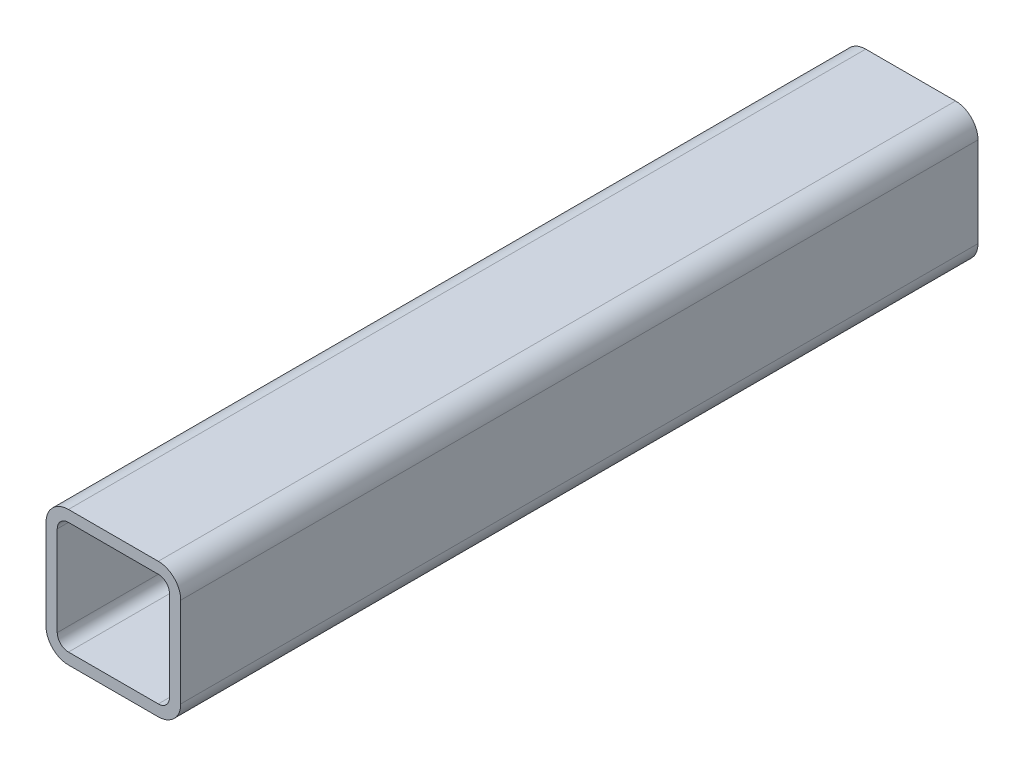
ISO-10303-21;
HEADER;
FILE_DESCRIPTION(('STEP AP214'),'2;1');
FILE_NAME('part.step','',(''),(''),'','','');
FILE_SCHEMA(('AUTOMOTIVE_DESIGN { 1 0 10303 214 1 1 1 1 }'));
ENDSEC;
DATA;
#1=APPLICATION_CONTEXT('core data for automotive mechanical design processes');
#2=APPLICATION_PROTOCOL_DEFINITION('international standard','automotive_design',2000,#1);
#3=PRODUCT_CONTEXT('',#1,'mechanical');
#4=PRODUCT('Part','Part','',(#3));
#5=PRODUCT_RELATED_PRODUCT_CATEGORY('part','',(#4));
#6=PRODUCT_DEFINITION_FORMATION('','',#4);
#7=PRODUCT_DEFINITION_CONTEXT('part definition',#1,'design');
#8=PRODUCT_DEFINITION('design','',#6,#7);
#9=PRODUCT_DEFINITION_SHAPE('','',#8);
#10=(LENGTH_UNIT() NAMED_UNIT(*) SI_UNIT(.MILLI.,.METRE.));
#11=(NAMED_UNIT(*) PLANE_ANGLE_UNIT() SI_UNIT($,.RADIAN.));
#12=(NAMED_UNIT(*) SI_UNIT($,.STERADIAN.) SOLID_ANGLE_UNIT());
#13=UNCERTAINTY_MEASURE_WITH_UNIT(LENGTH_MEASURE(1.E-05),#10,'distance_accuracy_value','');
#14=(GEOMETRIC_REPRESENTATION_CONTEXT(3) GLOBAL_UNCERTAINTY_ASSIGNED_CONTEXT((#13)) GLOBAL_UNIT_ASSIGNED_CONTEXT((#10,
#11,#12)) REPRESENTATION_CONTEXT('',''));
#15=CARTESIAN_POINT('',(0.,0.,0.));
#16=DIRECTION('',(0.,0.,1.));
#17=DIRECTION('',(1.,0.,0.));
#18=AXIS2_PLACEMENT_3D('',#15,#16,#17);
#19=CARTESIAN_POINT('',(-25.4,25.4,450.85));
#20=DIRECTION('',(0.,0.,-1.));
#21=DIRECTION('',(-1.,0.,0.));
#22=AXIS2_PLACEMENT_3D('',#19,#20,#21);
#23=CYLINDRICAL_SURFACE('',#22,12.7);
#24=CARTESIAN_POINT('',(-25.4,25.4,0.));
#25=DIRECTION('',(0.,0.,-1.));
#26=DIRECTION('',(-1.,0.,0.));
#27=AXIS2_PLACEMENT_3D('',#24,#25,#26);
#28=CIRCLE('',#27,12.7);
#29=CARTESIAN_POINT('',(-38.1,25.4,0.));
#30=VERTEX_POINT('',#29);
#31=CARTESIAN_POINT('',(-25.4,38.1,0.));
#32=VERTEX_POINT('',#31);
#33=EDGE_CURVE('E199',#30,#32,#28,.T.);
#34=ORIENTED_EDGE('',*,*,#33,.F.);
#35=DIRECTION('',(0.,0.,-1.));
#36=VECTOR('',#35,1.);
#37=CARTESIAN_POINT('',(-38.1,25.4,450.85));
#38=LINE('',#37,#36);
#39=CARTESIAN_POINT('',(-38.1,25.4,450.85));
#40=VERTEX_POINT('',#39);
#41=EDGE_CURVE('E11',#40,#30,#38,.T.);
#42=ORIENTED_EDGE('',*,*,#41,.F.);
#43=CARTESIAN_POINT('',(-25.4,25.4,450.85));
#44=DIRECTION('',(0.,0.,-1.));
#45=DIRECTION('',(-1.,0.,0.));
#46=AXIS2_PLACEMENT_3D('',#43,#44,#45);
#47=CIRCLE('',#46,12.7);
#48=CARTESIAN_POINT('',(-25.4,38.1,450.85));
#49=VERTEX_POINT('',#48);
#50=EDGE_CURVE('E211',#40,#49,#47,.T.);
#51=ORIENTED_EDGE('',*,*,#50,.T.);
#52=DIRECTION('',(0.,0.,-1.));
#53=VECTOR('',#52,1.);
#54=CARTESIAN_POINT('',(-25.4,38.1,450.85));
#55=LINE('',#54,#53);
#56=EDGE_CURVE('E35',#49,#32,#55,.T.);
#57=ORIENTED_EDGE('',*,*,#56,.T.);
#58=EDGE_LOOP('',(#34,#42,#51,#57));
#59=FACE_BOUND('',#58,.T.);
#60=ADVANCED_FACE('F32',(#59),#23,.T.);
#61=CARTESIAN_POINT('',(-38.1,25.4,450.85));
#62=DIRECTION('',(1.,0.,0.));
#63=DIRECTION('',(0.,0.,-1.));
#64=AXIS2_PLACEMENT_3D('',#61,#62,#63);
#65=PLANE('',#64);
#66=DIRECTION('',(0.,-1.,0.));
#67=VECTOR('',#66,1.);
#68=CARTESIAN_POINT('',(-38.1,25.4,0.));
#69=LINE('',#68,#67);
#70=CARTESIAN_POINT('',(-38.1,-25.4,0.));
#71=VERTEX_POINT('',#70);
#72=EDGE_CURVE('E215',#30,#71,#69,.T.);
#73=ORIENTED_EDGE('',*,*,#72,.T.);
#74=DIRECTION('',(0.,0.,-1.));
#75=VECTOR('',#74,1.);
#76=CARTESIAN_POINT('',(-38.1,-25.4,450.85));
#77=LINE('',#76,#75);
#78=CARTESIAN_POINT('',(-38.1,-25.4,450.85));
#79=VERTEX_POINT('',#78);
#80=EDGE_CURVE('E40',#79,#71,#77,.T.);
#81=ORIENTED_EDGE('',*,*,#80,.F.);
#82=DIRECTION('',(0.,-1.,0.));
#83=VECTOR('',#82,1.);
#84=CARTESIAN_POINT('',(-38.1,25.4,450.85));
#85=LINE('',#84,#83);
#86=EDGE_CURVE('E231',#40,#79,#85,.T.);
#87=ORIENTED_EDGE('',*,*,#86,.F.);
#88=ORIENTED_EDGE('',*,*,#41,.T.);
#89=EDGE_LOOP('',(#73,#81,#87,#88));
#90=FACE_BOUND('',#89,.T.);
#91=ADVANCED_FACE('F279',(#90),#65,.F.);
#92=CARTESIAN_POINT('',(-25.4,-25.4,450.85));
#93=DIRECTION('',(0.,0.,-1.));
#94=DIRECTION('',(-1.,0.,0.));
#95=AXIS2_PLACEMENT_3D('',#92,#93,#94);
#96=CYLINDRICAL_SURFACE('',#95,12.7);
#97=CARTESIAN_POINT('',(-25.4,-25.4,0.));
#98=DIRECTION('',(0.,0.,-1.));
#99=DIRECTION('',(-1.,0.,0.));
#100=AXIS2_PLACEMENT_3D('',#97,#98,#99);
#101=CIRCLE('',#100,12.7);
#102=CARTESIAN_POINT('',(-25.4,-38.1,0.));
#103=VERTEX_POINT('',#102);
#104=EDGE_CURVE('E249',#103,#71,#101,.T.);
#105=ORIENTED_EDGE('',*,*,#104,.F.);
#106=DIRECTION('',(0.,0.,-1.));
#107=VECTOR('',#106,1.);
#108=CARTESIAN_POINT('',(-25.4,-38.1,450.85));
#109=LINE('',#108,#107);
#110=CARTESIAN_POINT('',(-25.4,-38.1,450.85));
#111=VERTEX_POINT('',#110);
#112=EDGE_CURVE('E255',#111,#103,#109,.T.);
#113=ORIENTED_EDGE('',*,*,#112,.F.);
#114=CARTESIAN_POINT('',(-25.4,-25.4,450.85));
#115=DIRECTION('',(0.,0.,-1.));
#116=DIRECTION('',(-1.,0.,0.));
#117=AXIS2_PLACEMENT_3D('',#114,#115,#116);
#118=CIRCLE('',#117,12.7);
#119=EDGE_CURVE('E228',#111,#79,#118,.T.);
#120=ORIENTED_EDGE('',*,*,#119,.T.);
#121=ORIENTED_EDGE('',*,*,#80,.T.);
#122=EDGE_LOOP('',(#105,#113,#120,#121));
#123=FACE_BOUND('',#122,.T.);
#124=ADVANCED_FACE('F298',(#123),#96,.T.);
#125=CARTESIAN_POINT('',(25.4,-38.1,450.85));
#126=DIRECTION('',(0.,-1.,0.));
#127=DIRECTION('',(0.,0.,-1.));
#128=AXIS2_PLACEMENT_3D('',#125,#126,#127);
#129=PLANE('',#128);
#130=DIRECTION('',(-1.,0.,0.));
#131=VECTOR('',#130,1.);
#132=CARTESIAN_POINT('',(25.4,-38.1,0.));
#133=LINE('',#132,#131);
#134=CARTESIAN_POINT('',(25.4,-38.1,0.));
#135=VERTEX_POINT('',#134);
#136=EDGE_CURVE('E246',#135,#103,#133,.T.);
#137=ORIENTED_EDGE('',*,*,#136,.F.);
#138=DIRECTION('',(0.,0.,-1.));
#139=VECTOR('',#138,1.);
#140=CARTESIAN_POINT('',(25.4,-38.1,450.85));
#141=LINE('',#140,#139);
#142=CARTESIAN_POINT('',(25.4,-38.1,450.85));
#143=VERTEX_POINT('',#142);
#144=EDGE_CURVE('E257',#143,#135,#141,.T.);
#145=ORIENTED_EDGE('',*,*,#144,.F.);
#146=DIRECTION('',(-1.,0.,0.));
#147=VECTOR('',#146,1.);
#148=CARTESIAN_POINT('',(25.4,-38.1,450.85));
#149=LINE('',#148,#147);
#150=EDGE_CURVE('E225',#143,#111,#149,.T.);
#151=ORIENTED_EDGE('',*,*,#150,.T.);
#152=ORIENTED_EDGE('',*,*,#112,.T.);
#153=EDGE_LOOP('',(#137,#145,#151,#152));
#154=FACE_BOUND('',#153,.T.);
#155=ADVANCED_FACE('F296',(#154),#129,.T.);
#156=CARTESIAN_POINT('',(25.4,-25.4,450.85));
#157=DIRECTION('',(0.,0.,-1.));
#158=DIRECTION('',(-1.,0.,0.));
#159=AXIS2_PLACEMENT_3D('',#156,#157,#158);
#160=CYLINDRICAL_SURFACE('',#159,12.7);
#161=CARTESIAN_POINT('',(25.4,-25.4,0.));
#162=DIRECTION('',(0.,0.,-1.));
#163=DIRECTION('',(-1.,0.,0.));
#164=AXIS2_PLACEMENT_3D('',#161,#162,#163);
#165=CIRCLE('',#164,12.7);
#166=CARTESIAN_POINT('',(38.1,-25.4,0.));
#167=VERTEX_POINT('',#166);
#168=EDGE_CURVE('E243',#167,#135,#165,.T.);
#169=ORIENTED_EDGE('',*,*,#168,.F.);
#170=DIRECTION('',(0.,0.,-1.));
#171=VECTOR('',#170,1.);
#172=CARTESIAN_POINT('',(38.1,-25.4,450.85));
#173=LINE('',#172,#171);
#174=CARTESIAN_POINT('',(38.1,-25.4,450.85));
#175=VERTEX_POINT('',#174);
#176=EDGE_CURVE('E259',#175,#167,#173,.T.);
#177=ORIENTED_EDGE('',*,*,#176,.F.);
#178=CARTESIAN_POINT('',(25.4,-25.4,450.85));
#179=DIRECTION('',(0.,0.,-1.));
#180=DIRECTION('',(-1.,0.,0.));
#181=AXIS2_PLACEMENT_3D('',#178,#179,#180);
#182=CIRCLE('',#181,12.7);
#183=EDGE_CURVE('E222',#175,#143,#182,.T.);
#184=ORIENTED_EDGE('',*,*,#183,.T.);
#185=ORIENTED_EDGE('',*,*,#144,.T.);
#186=EDGE_LOOP('',(#169,#177,#184,#185));
#187=FACE_BOUND('',#186,.T.);
#188=ADVANCED_FACE('F292',(#187),#160,.T.);
#189=CARTESIAN_POINT('',(38.1,-25.4,450.85));
#190=DIRECTION('',(-1.,0.,0.));
#191=DIRECTION('',(0.,0.,1.));
#192=AXIS2_PLACEMENT_3D('',#189,#190,#191);
#193=PLANE('',#192);
#194=DIRECTION('',(0.,1.,0.));
#195=VECTOR('',#194,1.);
#196=CARTESIAN_POINT('',(38.1,-25.4,0.));
#197=LINE('',#196,#195);
#198=CARTESIAN_POINT('',(38.1,25.4,0.));
#199=VERTEX_POINT('',#198);
#200=EDGE_CURVE('E241',#167,#199,#197,.T.);
#201=ORIENTED_EDGE('',*,*,#200,.T.);
#202=DIRECTION('',(0.,0.,-1.));
#203=VECTOR('',#202,1.);
#204=CARTESIAN_POINT('',(38.1,25.4,450.85));
#205=LINE('',#204,#203);
#206=CARTESIAN_POINT('',(38.1,25.4,450.85));
#207=VERTEX_POINT('',#206);
#208=EDGE_CURVE('E261',#207,#199,#205,.T.);
#209=ORIENTED_EDGE('',*,*,#208,.F.);
#210=DIRECTION('',(0.,1.,0.));
#211=VECTOR('',#210,1.);
#212=CARTESIAN_POINT('',(38.1,-25.4,450.85));
#213=LINE('',#212,#211);
#214=EDGE_CURVE('E220',#175,#207,#213,.T.);
#215=ORIENTED_EDGE('',*,*,#214,.F.);
#216=ORIENTED_EDGE('',*,*,#176,.T.);
#217=EDGE_LOOP('',(#201,#209,#215,#216));
#218=FACE_BOUND('',#217,.T.);
#219=ADVANCED_FACE('F333',(#218),#193,.F.);
#220=CARTESIAN_POINT('',(25.4,25.4,450.85));
#221=DIRECTION('',(0.,0.,-1.));
#222=DIRECTION('',(-1.,0.,0.));
#223=AXIS2_PLACEMENT_3D('',#220,#221,#222);
#224=CYLINDRICAL_SURFACE('',#223,12.7);
#225=CARTESIAN_POINT('',(25.4,25.4,0.));
#226=DIRECTION('',(0.,0.,1.));
#227=DIRECTION('',(1.,0.,0.));
#228=AXIS2_PLACEMENT_3D('',#225,#226,#227);
#229=CIRCLE('',#228,12.7);
#230=CARTESIAN_POINT('',(25.4,38.1,0.));
#231=VERTEX_POINT('',#230);
#232=EDGE_CURVE('E238',#199,#231,#229,.T.);
#233=ORIENTED_EDGE('',*,*,#232,.T.);
#234=DIRECTION('',(0.,0.,-1.));
#235=VECTOR('',#234,1.);
#236=CARTESIAN_POINT('',(25.4,38.1,450.85));
#237=LINE('',#236,#235);
#238=CARTESIAN_POINT('',(25.4,38.1,450.85));
#239=VERTEX_POINT('',#238);
#240=EDGE_CURVE('E263',#239,#231,#237,.T.);
#241=ORIENTED_EDGE('',*,*,#240,.F.);
#242=CARTESIAN_POINT('',(25.4,25.4,450.85));
#243=DIRECTION('',(0.,0.,1.));
#244=DIRECTION('',(1.,0.,0.));
#245=AXIS2_PLACEMENT_3D('',#242,#243,#244);
#246=CIRCLE('',#245,12.7);
#247=EDGE_CURVE('E218',#207,#239,#246,.T.);
#248=ORIENTED_EDGE('',*,*,#247,.F.);
#249=ORIENTED_EDGE('',*,*,#208,.T.);
#250=EDGE_LOOP('',(#233,#241,#248,#249));
#251=FACE_BOUND('',#250,.T.);
#252=ADVANCED_FACE('F287',(#251),#224,.T.);
#253=CARTESIAN_POINT('',(-25.4,38.1,450.85));
#254=DIRECTION('',(0.,1.,0.));
#255=DIRECTION('',(0.,0.,1.));
#256=AXIS2_PLACEMENT_3D('',#253,#254,#255);
#257=PLANE('',#256);
#258=DIRECTION('',(1.,0.,0.));
#259=VECTOR('',#258,1.);
#260=CARTESIAN_POINT('',(-25.4,38.1,0.));
#261=LINE('',#260,#259);
#262=EDGE_CURVE('E235',#32,#231,#261,.T.);
#263=ORIENTED_EDGE('',*,*,#262,.F.);
#264=ORIENTED_EDGE('',*,*,#56,.F.);
#265=DIRECTION('',(1.,0.,0.));
#266=VECTOR('',#265,1.);
#267=CARTESIAN_POINT('',(-25.4,38.1,450.85));
#268=LINE('',#267,#266);
#269=EDGE_CURVE('E214',#49,#239,#268,.T.);
#270=ORIENTED_EDGE('',*,*,#269,.T.);
#271=ORIENTED_EDGE('',*,*,#240,.T.);
#272=EDGE_LOOP('',(#263,#264,#270,#271));
#273=FACE_BOUND('',#272,.T.);
#274=ADVANCED_FACE('F271',(#273),#257,.T.);
#275=CARTESIAN_POINT('',(-25.4,25.4,450.85));
#276=DIRECTION('',(0.,0.,-1.));
#277=DIRECTION('',(-1.,0.,0.));
#278=AXIS2_PLACEMENT_3D('',#275,#276,#277);
#279=PLANE('',#278);
#280=DIRECTION('',(0.,-1.,0.));
#281=VECTOR('',#280,1.);
#282=CARTESIAN_POINT('',(-31.75,25.4,450.85));
#283=LINE('',#282,#281);
#284=CARTESIAN_POINT('',(-31.75,25.4,450.85));
#285=VERTEX_POINT('',#284);
#286=CARTESIAN_POINT('',(-31.75,-25.4,450.85));
#287=VERTEX_POINT('',#286);
#288=EDGE_CURVE('E150',#285,#287,#283,.T.);
#289=ORIENTED_EDGE('',*,*,#288,.F.);
#290=CARTESIAN_POINT('',(-25.4,25.4,450.85));
#291=DIRECTION('',(0.,0.,-1.));
#292=DIRECTION('',(-1.,0.,0.));
#293=AXIS2_PLACEMENT_3D('',#290,#291,#292);
#294=CIRCLE('',#293,6.35000000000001);
#295=CARTESIAN_POINT('',(-25.4,31.75,450.85));
#296=VERTEX_POINT('',#295);
#297=EDGE_CURVE('E147',#285,#296,#294,.T.);
#298=ORIENTED_EDGE('',*,*,#297,.T.);
#299=DIRECTION('',(1.,0.,0.));
#300=VECTOR('',#299,1.);
#301=CARTESIAN_POINT('',(-25.4,31.75,450.85));
#302=LINE('',#301,#300);
#303=CARTESIAN_POINT('',(25.4,31.75,450.85));
#304=VERTEX_POINT('',#303);
#305=EDGE_CURVE('E153',#296,#304,#302,.T.);
#306=ORIENTED_EDGE('',*,*,#305,.T.);
#307=CARTESIAN_POINT('',(25.4,25.4,450.85));
#308=DIRECTION('',(0.,0.,-1.));
#309=DIRECTION('',(-1.,0.,0.));
#310=AXIS2_PLACEMENT_3D('',#307,#308,#309);
#311=CIRCLE('',#310,6.35000000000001);
#312=CARTESIAN_POINT('',(31.75,25.4,450.85));
#313=VERTEX_POINT('',#312);
#314=EDGE_CURVE('E157',#313,#304,#311,.F.);
#315=ORIENTED_EDGE('',*,*,#314,.F.);
#316=DIRECTION('',(0.,1.,0.));
#317=VECTOR('',#316,1.);
#318=CARTESIAN_POINT('',(31.75,25.4,450.85));
#319=LINE('',#318,#317);
#320=CARTESIAN_POINT('',(31.75,-25.4,450.85));
#321=VERTEX_POINT('',#320);
#322=EDGE_CURVE('E169',#321,#313,#319,.T.);
#323=ORIENTED_EDGE('',*,*,#322,.F.);
#324=CARTESIAN_POINT('',(25.4,-25.4,450.85));
#325=DIRECTION('',(0.,0.,-1.));
#326=DIRECTION('',(-1.,0.,0.));
#327=AXIS2_PLACEMENT_3D('',#324,#325,#326);
#328=CIRCLE('',#327,6.35000000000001);
#329=CARTESIAN_POINT('',(25.4,-31.75,450.85));
#330=VERTEX_POINT('',#329);
#331=EDGE_CURVE('E171',#321,#330,#328,.T.);
#332=ORIENTED_EDGE('',*,*,#331,.T.);
#333=DIRECTION('',(-1.,0.,0.));
#334=VECTOR('',#333,1.);
#335=CARTESIAN_POINT('',(-25.4,-31.75,450.85));
#336=LINE('',#335,#334);
#337=CARTESIAN_POINT('',(-25.4,-31.75,450.85));
#338=VERTEX_POINT('',#337);
#339=EDGE_CURVE('E174',#330,#338,#336,.T.);
#340=ORIENTED_EDGE('',*,*,#339,.T.);
#341=CARTESIAN_POINT('',(-25.4,-25.4,450.85));
#342=DIRECTION('',(0.,0.,-1.));
#343=DIRECTION('',(-1.,0.,0.));
#344=AXIS2_PLACEMENT_3D('',#341,#342,#343);
#345=CIRCLE('',#344,6.35000000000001);
#346=EDGE_CURVE('E177',#338,#287,#345,.T.);
#347=ORIENTED_EDGE('',*,*,#346,.T.);
#348=EDGE_LOOP('',(#289,#298,#306,#315,#323,#332,#340,#347));
#349=FACE_BOUND('',#348,.T.);
#350=ORIENTED_EDGE('',*,*,#50,.F.);
#351=ORIENTED_EDGE('',*,*,#86,.T.);
#352=ORIENTED_EDGE('',*,*,#119,.F.);
#353=ORIENTED_EDGE('',*,*,#150,.F.);
#354=ORIENTED_EDGE('',*,*,#183,.F.);
#355=ORIENTED_EDGE('',*,*,#214,.T.);
#356=ORIENTED_EDGE('',*,*,#247,.T.);
#357=ORIENTED_EDGE('',*,*,#269,.F.);
#358=EDGE_LOOP('',(#350,#351,#352,#353,#354,#355,#356,#357));
#359=FACE_BOUND('',#358,.T.);
#360=ADVANCED_FACE('F159',(#349,#359),#279,.F.);
#361=CARTESIAN_POINT('',(-25.4,25.4,0.));
#362=DIRECTION('',(0.,0.,-1.));
#363=DIRECTION('',(-1.,0.,0.));
#364=AXIS2_PLACEMENT_3D('',#361,#362,#363);
#365=PLANE('',#364);
#366=CARTESIAN_POINT('',(-25.4,25.4,0.));
#367=DIRECTION('',(0.,0.,-1.));
#368=DIRECTION('',(-1.,0.,0.));
#369=AXIS2_PLACEMENT_3D('',#366,#367,#368);
#370=CIRCLE('',#369,6.35000000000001);
#371=CARTESIAN_POINT('',(-31.75,25.4,0.));
#372=VERTEX_POINT('',#371);
#373=CARTESIAN_POINT('',(-25.4,31.75,0.));
#374=VERTEX_POINT('',#373);
#375=EDGE_CURVE('E56',#372,#374,#370,.T.);
#376=ORIENTED_EDGE('',*,*,#375,.F.);
#377=DIRECTION('',(0.,-1.,0.));
#378=VECTOR('',#377,1.);
#379=CARTESIAN_POINT('',(-31.75,25.4,0.));
#380=LINE('',#379,#378);
#381=CARTESIAN_POINT('',(-31.75,-25.4,0.));
#382=VERTEX_POINT('',#381);
#383=EDGE_CURVE('E162',#372,#382,#380,.T.);
#384=ORIENTED_EDGE('',*,*,#383,.T.);
#385=CARTESIAN_POINT('',(-25.4,-25.4,0.));
#386=DIRECTION('',(0.,0.,-1.));
#387=DIRECTION('',(-1.,0.,0.));
#388=AXIS2_PLACEMENT_3D('',#385,#386,#387);
#389=CIRCLE('',#388,6.35000000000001);
#390=CARTESIAN_POINT('',(-25.4,-31.75,0.));
#391=VERTEX_POINT('',#390);
#392=EDGE_CURVE('E165',#391,#382,#389,.T.);
#393=ORIENTED_EDGE('',*,*,#392,.F.);
#394=DIRECTION('',(-1.,0.,0.));
#395=VECTOR('',#394,1.);
#396=CARTESIAN_POINT('',(-25.4,-31.75,0.));
#397=LINE('',#396,#395);
#398=CARTESIAN_POINT('',(25.4,-31.75,0.));
#399=VERTEX_POINT('',#398);
#400=EDGE_CURVE('E192',#399,#391,#397,.T.);
#401=ORIENTED_EDGE('',*,*,#400,.F.);
#402=CARTESIAN_POINT('',(25.4,-25.4,0.));
#403=DIRECTION('',(0.,0.,-1.));
#404=DIRECTION('',(-1.,0.,0.));
#405=AXIS2_PLACEMENT_3D('',#402,#403,#404);
#406=CIRCLE('',#405,6.35000000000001);
#407=CARTESIAN_POINT('',(31.75,-25.4,0.));
#408=VERTEX_POINT('',#407);
#409=EDGE_CURVE('E189',#408,#399,#406,.T.);
#410=ORIENTED_EDGE('',*,*,#409,.F.);
#411=DIRECTION('',(0.,1.,0.));
#412=VECTOR('',#411,1.);
#413=CARTESIAN_POINT('',(31.75,25.4,0.));
#414=LINE('',#413,#412);
#415=CARTESIAN_POINT('',(31.75,25.4,0.));
#416=VERTEX_POINT('',#415);
#417=EDGE_CURVE('E186',#408,#416,#414,.T.);
#418=ORIENTED_EDGE('',*,*,#417,.T.);
#419=CARTESIAN_POINT('',(25.4,25.4,0.));
#420=DIRECTION('',(0.,0.,-1.));
#421=DIRECTION('',(-1.,0.,0.));
#422=AXIS2_PLACEMENT_3D('',#419,#420,#421);
#423=CIRCLE('',#422,6.35000000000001);
#424=CARTESIAN_POINT('',(25.4,31.75,0.));
#425=VERTEX_POINT('',#424);
#426=EDGE_CURVE('E183',#416,#425,#423,.F.);
#427=ORIENTED_EDGE('',*,*,#426,.T.);
#428=DIRECTION('',(1.,0.,0.));
#429=VECTOR('',#428,1.);
#430=CARTESIAN_POINT('',(-25.4,31.75,0.));
#431=LINE('',#430,#429);
#432=EDGE_CURVE('E181',#374,#425,#431,.T.);
#433=ORIENTED_EDGE('',*,*,#432,.F.);
#434=EDGE_LOOP('',(#376,#384,#393,#401,#410,#418,#427,#433));
#435=FACE_BOUND('',#434,.T.);
#436=ORIENTED_EDGE('',*,*,#33,.T.);
#437=ORIENTED_EDGE('',*,*,#262,.T.);
#438=ORIENTED_EDGE('',*,*,#232,.F.);
#439=ORIENTED_EDGE('',*,*,#200,.F.);
#440=ORIENTED_EDGE('',*,*,#168,.T.);
#441=ORIENTED_EDGE('',*,*,#136,.T.);
#442=ORIENTED_EDGE('',*,*,#104,.T.);
#443=ORIENTED_EDGE('',*,*,#72,.F.);
#444=EDGE_LOOP('',(#436,#437,#438,#439,#440,#441,#442,#443));
#445=FACE_BOUND('',#444,.T.);
#446=ADVANCED_FACE('F275',(#435,#445),#365,.T.);
#447=CARTESIAN_POINT('',(-25.4,25.4,450.85));
#448=DIRECTION('',(0.,0.,-1.));
#449=DIRECTION('',(-1.,0.,0.));
#450=AXIS2_PLACEMENT_3D('',#447,#448,#449);
#451=CYLINDRICAL_SURFACE('',#450,6.35000000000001);
#452=ORIENTED_EDGE('',*,*,#375,.T.);
#453=DIRECTION('',(0.,0.,-1.));
#454=VECTOR('',#453,1.);
#455=CARTESIAN_POINT('',(-25.4,31.75,450.85));
#456=LINE('',#455,#454);
#457=EDGE_CURVE('E144',#296,#374,#456,.T.);
#458=ORIENTED_EDGE('',*,*,#457,.F.);
#459=ORIENTED_EDGE('',*,*,#297,.F.);
#460=DIRECTION('',(0.,0.,-1.));
#461=VECTOR('',#460,1.);
#462=CARTESIAN_POINT('',(-31.75,25.4,450.85));
#463=LINE('',#462,#461);
#464=EDGE_CURVE('E197',#285,#372,#463,.T.);
#465=ORIENTED_EDGE('',*,*,#464,.T.);
#466=EDGE_LOOP('',(#452,#458,#459,#465));
#467=FACE_BOUND('',#466,.T.);
#468=ADVANCED_FACE('F145',(#467),#451,.F.);
#469=CARTESIAN_POINT('',(-31.75,25.4,450.85));
#470=DIRECTION('',(1.,0.,0.));
#471=DIRECTION('',(0.,0.,-1.));
#472=AXIS2_PLACEMENT_3D('',#469,#470,#471);
#473=PLANE('',#472);
#474=ORIENTED_EDGE('',*,*,#383,.F.);
#475=ORIENTED_EDGE('',*,*,#464,.F.);
#476=ORIENTED_EDGE('',*,*,#288,.T.);
#477=DIRECTION('',(0.,0.,-1.));
#478=VECTOR('',#477,1.);
#479=CARTESIAN_POINT('',(-31.75,-25.4,450.85));
#480=LINE('',#479,#478);
#481=EDGE_CURVE('E200',#287,#382,#480,.T.);
#482=ORIENTED_EDGE('',*,*,#481,.T.);
#483=EDGE_LOOP('',(#474,#475,#476,#482));
#484=FACE_BOUND('',#483,.T.);
#485=ADVANCED_FACE('F382',(#484),#473,.T.);
#486=CARTESIAN_POINT('',(-25.4,-25.4,450.85));
#487=DIRECTION('',(0.,0.,-1.));
#488=DIRECTION('',(-1.,0.,0.));
#489=AXIS2_PLACEMENT_3D('',#486,#487,#488);
#490=CYLINDRICAL_SURFACE('',#489,6.35000000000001);
#491=ORIENTED_EDGE('',*,*,#392,.T.);
#492=ORIENTED_EDGE('',*,*,#481,.F.);
#493=ORIENTED_EDGE('',*,*,#346,.F.);
#494=DIRECTION('',(0.,0.,-1.));
#495=VECTOR('',#494,1.);
#496=CARTESIAN_POINT('',(-25.4,-31.75,450.85));
#497=LINE('',#496,#495);
#498=EDGE_CURVE('E202',#338,#391,#497,.T.);
#499=ORIENTED_EDGE('',*,*,#498,.T.);
#500=EDGE_LOOP('',(#491,#492,#493,#499));
#501=FACE_BOUND('',#500,.T.);
#502=ADVANCED_FACE('F391',(#501),#490,.F.);
#503=CARTESIAN_POINT('',(-25.4,-31.75,450.85));
#504=DIRECTION('',(0.,-1.,0.));
#505=DIRECTION('',(0.,0.,-1.));
#506=AXIS2_PLACEMENT_3D('',#503,#504,#505);
#507=PLANE('',#506);
#508=ORIENTED_EDGE('',*,*,#400,.T.);
#509=ORIENTED_EDGE('',*,*,#498,.F.);
#510=ORIENTED_EDGE('',*,*,#339,.F.);
#511=DIRECTION('',(0.,0.,-1.));
#512=VECTOR('',#511,1.);
#513=CARTESIAN_POINT('',(25.4,-31.75,450.85));
#514=LINE('',#513,#512);
#515=EDGE_CURVE('E204',#330,#399,#514,.T.);
#516=ORIENTED_EDGE('',*,*,#515,.T.);
#517=EDGE_LOOP('',(#508,#509,#510,#516));
#518=FACE_BOUND('',#517,.T.);
#519=ADVANCED_FACE('F401',(#518),#507,.F.);
#520=CARTESIAN_POINT('',(25.4,-25.4,450.85));
#521=DIRECTION('',(0.,0.,-1.));
#522=DIRECTION('',(-1.,0.,0.));
#523=AXIS2_PLACEMENT_3D('',#520,#521,#522);
#524=CYLINDRICAL_SURFACE('',#523,6.35000000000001);
#525=ORIENTED_EDGE('',*,*,#409,.T.);
#526=ORIENTED_EDGE('',*,*,#515,.F.);
#527=ORIENTED_EDGE('',*,*,#331,.F.);
#528=DIRECTION('',(0.,0.,-1.));
#529=VECTOR('',#528,1.);
#530=CARTESIAN_POINT('',(31.75,-25.4,450.85));
#531=LINE('',#530,#529);
#532=EDGE_CURVE('E206',#321,#408,#531,.T.);
#533=ORIENTED_EDGE('',*,*,#532,.T.);
#534=EDGE_LOOP('',(#525,#526,#527,#533));
#535=FACE_BOUND('',#534,.T.);
#536=ADVANCED_FACE('F411',(#535),#524,.F.);
#537=CARTESIAN_POINT('',(31.75,25.4,450.85));
#538=DIRECTION('',(-1.,0.,0.));
#539=DIRECTION('',(0.,0.,1.));
#540=AXIS2_PLACEMENT_3D('',#537,#538,#539);
#541=PLANE('',#540);
#542=ORIENTED_EDGE('',*,*,#417,.F.);
#543=ORIENTED_EDGE('',*,*,#532,.F.);
#544=ORIENTED_EDGE('',*,*,#322,.T.);
#545=DIRECTION('',(0.,0.,-1.));
#546=VECTOR('',#545,1.);
#547=CARTESIAN_POINT('',(31.75,25.4,450.85));
#548=LINE('',#547,#546);
#549=EDGE_CURVE('E208',#313,#416,#548,.T.);
#550=ORIENTED_EDGE('',*,*,#549,.T.);
#551=EDGE_LOOP('',(#542,#543,#544,#550));
#552=FACE_BOUND('',#551,.T.);
#553=ADVANCED_FACE('F421',(#552),#541,.T.);
#554=CARTESIAN_POINT('',(25.4,25.4,450.85));
#555=DIRECTION('',(0.,0.,-1.));
#556=DIRECTION('',(-1.,0.,0.));
#557=AXIS2_PLACEMENT_3D('',#554,#555,#556);
#558=CYLINDRICAL_SURFACE('',#557,6.35000000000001);
#559=ORIENTED_EDGE('',*,*,#426,.F.);
#560=ORIENTED_EDGE('',*,*,#549,.F.);
#561=ORIENTED_EDGE('',*,*,#314,.T.);
#562=DIRECTION('',(0.,0.,-1.));
#563=VECTOR('',#562,1.);
#564=CARTESIAN_POINT('',(25.4,31.75,450.85));
#565=LINE('',#564,#563);
#566=EDGE_CURVE('E48',#304,#425,#565,.T.);
#567=ORIENTED_EDGE('',*,*,#566,.T.);
#568=EDGE_LOOP('',(#559,#560,#561,#567));
#569=FACE_BOUND('',#568,.T.);
#570=ADVANCED_FACE('F431',(#569),#558,.F.);
#571=CARTESIAN_POINT('',(-25.4,31.75,450.85));
#572=DIRECTION('',(0.,1.,0.));
#573=DIRECTION('',(0.,0.,1.));
#574=AXIS2_PLACEMENT_3D('',#571,#572,#573);
#575=PLANE('',#574);
#576=ORIENTED_EDGE('',*,*,#432,.T.);
#577=ORIENTED_EDGE('',*,*,#566,.F.);
#578=ORIENTED_EDGE('',*,*,#305,.F.);
#579=ORIENTED_EDGE('',*,*,#457,.T.);
#580=EDGE_LOOP('',(#576,#577,#578,#579));
#581=FACE_BOUND('',#580,.T.);
#582=ADVANCED_FACE('F154',(#581),#575,.F.);
#583=CLOSED_SHELL('',(#60,#91,#124,#155,#188,#219,#252,#274,#360,#446,#468,#485,#502,#519,#536,
#553,#570,#582));
#584=MANIFOLD_SOLID_BREP('B2',#583);
#585=ADVANCED_BREP_SHAPE_REPRESENTATION('',(#18,#584),#14);
#586=SHAPE_DEFINITION_REPRESENTATION(#9,#585);
ENDSEC;
END-ISO-10303-21;
